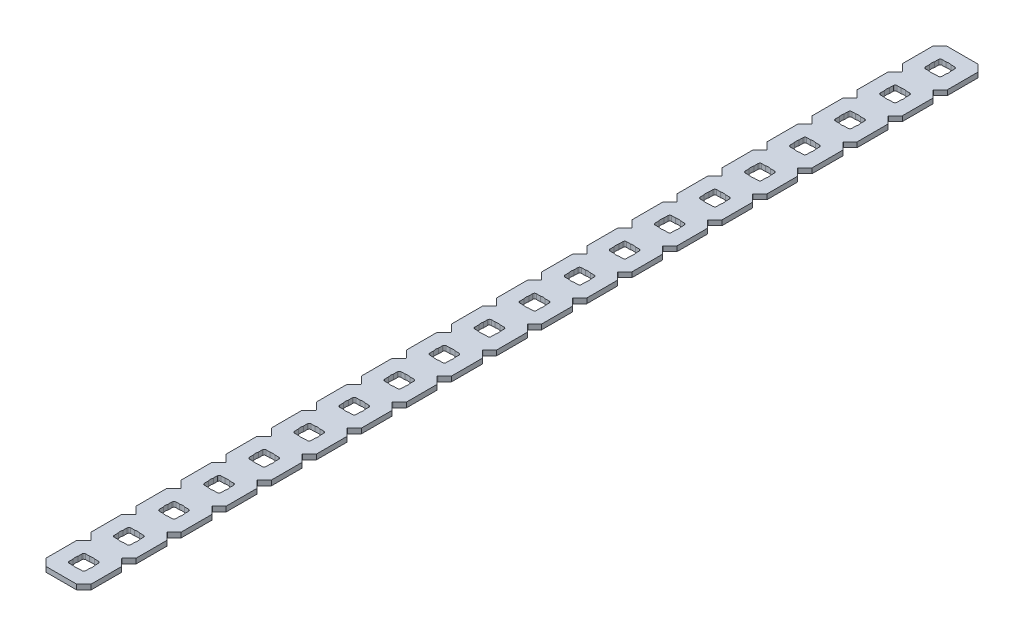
from build123d import *

# Parameters (mm, degrees)
BOSS_EXTRUDE1_DEPTH = 1.4224
SKETCH2_R           = 2.413
CUT_EXTRUDE1_DEPTH  = 2.54
LPATTERN1_COUNT     = 25
LPATTERN1_PITCH     = 12.7
SKETCH3_W           = 12.7
SKETCH3_H           = 63.589802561
CUT_EXTRUDE2_DEPTH  = 318.757082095


with BuildPart() as part:
    # Sketch1 → Boss-Extrude1 (new body)
    with BuildSketch(Plane.XZ):
        with BuildLine():
            Line((12.7, -302.773014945), (12.7, -294.126985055))
            Line((12.7, -294.126985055), (10.762817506, -292.189802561))
            ThreePointArc((10.762817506, -292.189802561), (10.725620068, -292.1), (10.762817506, -292.010197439))
            Line((10.762817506, -292.010197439), (12.7, -290.073014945))
            Line((12.7, -290.073014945), (12.7, -281.426985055))
            Line((12.7, -281.426985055), (10.762817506, -279.489802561))
            ThreePointArc((10.762817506, -279.489802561), (10.725620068, -279.4), (10.762817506, -279.310197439))
            Line((10.762817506, -279.310197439), (12.7, -277.373014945))
            Line((12.7, -277.373014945), (12.7, -268.726985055))
            Line((12.7, -268.726985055), (10.762817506, -266.789802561))
            ThreePointArc((10.762817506, -266.789802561), (10.725620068, -266.7), (10.762817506, -266.610197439))
            Line((10.762817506, -266.610197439), (12.7, -264.673014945))
            Line((12.7, -264.673014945), (12.7, -256.026985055))
            Line((12.7, -256.026985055), (10.762817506, -254.089802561))
            ThreePointArc((10.762817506, -254.089802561), (10.725620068, -254), (10.762817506, -253.910197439))
            Line((10.762817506, -253.910197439), (12.7, -251.973014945))
            Line((12.7, -251.973014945), (12.7, -243.326985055))
            Line((12.7, -243.326985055), (10.762817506, -241.389802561))
            ThreePointArc((10.762817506, -241.389802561), (10.725620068, -241.3), (10.762817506, -241.210197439))
            Line((10.762817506, -241.210197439), (12.7, -239.273014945))
            Line((12.7, -239.273014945), (12.7, -230.626985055))
            Line((12.7, -230.626985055), (10.762817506, -228.689802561))
            ThreePointArc((10.762817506, -228.689802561), (10.725620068, -228.6), (10.762817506, -228.510197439))
            Line((10.762817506, -228.510197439), (12.7, -226.573014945))
            Line((12.7, -226.573014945), (12.7, -217.926985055))
            Line((12.7, -217.926985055), (10.762817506, -215.989802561))
            ThreePointArc((10.762817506, -215.989802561), (10.725620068, -215.9), (10.762817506, -215.810197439))
            Line((10.762817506, -215.810197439), (12.7, -213.873014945))
            Line((12.7, -213.873014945), (12.7, -205.226985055))
            Line((12.7, -205.226985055), (10.762817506, -203.289802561))
            ThreePointArc((10.762817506, -203.289802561), (10.725620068, -203.2), (10.762817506, -203.110197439))
            Line((10.762817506, -203.110197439), (12.7, -201.173014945))
            Line((12.7, -201.173014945), (12.7, -192.526985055))
            Line((12.7, -192.526985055), (10.762817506, -190.589802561))
            ThreePointArc((10.762817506, -190.589802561), (10.725620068, -190.5), (10.762817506, -190.410197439))
            Line((10.762817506, -190.410197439), (12.7, -188.473014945))
            Line((12.7, -188.473014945), (12.7, -179.826985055))
            Line((12.7, -179.826985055), (10.762817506, -177.889802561))
            ThreePointArc((10.762817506, -177.889802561), (10.725620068, -177.8), (10.762817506, -177.710197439))
            Line((10.762817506, -177.710197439), (12.7, -175.773014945))
            Line((12.7, -175.773014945), (12.7, -167.126985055))
            Line((12.7, -167.126985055), (10.762817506, -165.189802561))
            ThreePointArc((10.762817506, -165.189802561), (10.725620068, -165.1), (10.762817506, -165.010197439))
            Line((10.762817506, -165.010197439), (12.7, -163.073014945))
            Line((12.7, -163.073014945), (12.7, -154.426985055))
            Line((12.7, -154.426985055), (10.762817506, -152.489802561))
            ThreePointArc((10.762817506, -152.489802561), (10.725620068, -152.4), (10.762817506, -152.310197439))
            Line((10.762817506, -152.310197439), (12.7, -150.373014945))
            Line((12.7, -150.373014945), (12.7, -141.726985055))
            Line((12.7, -141.726985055), (10.762817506, -139.789802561))
            ThreePointArc((10.762817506, -139.789802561), (10.725620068, -139.7), (10.762817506, -139.610197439))
            Line((10.762817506, -139.610197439), (12.7, -137.673014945))
            Line((12.7, -137.673014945), (12.7, -129.026985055))
            Line((12.7, -129.026985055), (10.762817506, -127.089802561))
            ThreePointArc((10.762817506, -127.089802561), (10.725620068, -127), (10.762817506, -126.910197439))
            Line((10.762817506, -126.910197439), (12.7, -124.973014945))
            Line((12.7, -124.973014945), (12.7, -116.326985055))
            Line((12.7, -116.326985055), (10.762817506, -114.389802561))
            ThreePointArc((10.762817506, -114.389802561), (10.725620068, -114.3), (10.762817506, -114.210197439))
            Line((10.762817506, -114.210197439), (12.7, -112.273014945))
            Line((12.7, -112.273014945), (12.7, -103.626985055))
            Line((12.7, -103.626985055), (10.762817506, -101.689802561))
            ThreePointArc((10.762817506, -101.689802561), (10.725620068, -101.6), (10.762817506, -101.510197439))
            Line((10.762817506, -101.510197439), (12.7, -99.573014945))
            Line((12.7, -99.573014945), (12.7, -90.926985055))
            Line((12.7, -90.926985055), (10.762817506, -88.989802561))
            ThreePointArc((10.762817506, -88.989802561), (10.725620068, -88.9), (10.762817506, -88.810197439))
            Line((10.762817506, -88.810197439), (12.7, -86.873014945))
            Line((12.7, -86.873014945), (12.7, -78.226985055))
            Line((12.7, -78.226985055), (10.762817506, -76.289802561))
            ThreePointArc((10.762817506, -76.289802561), (10.725620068, -76.2), (10.762817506, -76.110197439))
            Line((10.762817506, -76.110197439), (12.7, -74.173014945))
            Line((12.7, -74.173014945), (12.7, -65.526985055))
            Line((12.7, -65.526985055), (10.762817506, -63.589802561))
            ThreePointArc((10.762817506, -63.589802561), (10.725620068, -63.5), (10.762817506, -63.410197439))
            Line((10.762817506, -63.410197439), (12.7, -61.473014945))
            Line((12.7, -61.473014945), (12.7, -52.826985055))
            Line((12.7, -52.826985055), (10.762817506, -50.889802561))
            ThreePointArc((10.762817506, -50.889802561), (10.725620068, -50.8), (10.762817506, -50.710197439))
            Line((10.762817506, -50.710197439), (12.7, -48.773014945))
            Line((12.7, -48.773014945), (12.7, -40.126985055))
            Line((12.7, -40.126985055), (10.762817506, -38.189802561))
            ThreePointArc((10.762817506, -38.189802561), (10.725620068, -38.1), (10.762817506, -38.010197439))
            Line((10.762817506, -38.010197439), (12.7, -36.073014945))
            Line((12.7, -36.073014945), (12.7, -27.426985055))
            Line((12.7, -27.426985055), (10.762817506, -25.489802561))
            ThreePointArc((10.762817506, -25.489802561), (10.725620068, -25.4), (10.762817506, -25.310197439))
            Line((10.762817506, -25.310197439), (12.7, -23.373014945))
            Line((12.7, -23.373014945), (12.7, -14.726985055))
            Line((12.7, -14.726985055), (10.762817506, -12.789802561))
            ThreePointArc((10.762817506, -12.789802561), (10.725620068, -12.7), (10.762817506, -12.610197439))
            Line((10.762817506, -12.610197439), (12.7, -10.673014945))
            Line((12.7, -10.673014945), (12.7, -2.032))
            Line((12.7, -2.032), (10.668, 0))
            Line((10.668, 0), (2.032, 0))
            Line((2.032, 0), (0, -2.032))
            Line((0, -2.032), (0, -10.673014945))
            Line((0, -10.673014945), (1.937182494, -12.610197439))
            ThreePointArc((1.937182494, -12.610197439), (1.974379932, -12.7), (1.937182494, -12.789802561))
            Line((1.937182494, -12.789802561), (0, -14.726985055))
            Line((0, -14.726985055), (0, -23.373014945))
            Line((0, -23.373014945), (1.937182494, -25.310197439))
            ThreePointArc((1.937182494, -25.310197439), (1.974379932, -25.4), (1.937182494, -25.489802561))
            Line((1.937182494, -25.489802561), (0, -27.426985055))
            Line((0, -27.426985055), (0, -36.073014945))
            Line((0, -36.073014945), (1.937182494, -38.010197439))
            ThreePointArc((1.937182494, -38.010197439), (1.974379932, -38.1), (1.937182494, -38.189802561))
            Line((1.937182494, -38.189802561), (0, -40.126985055))
            Line((0, -40.126985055), (0, -48.773014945))
            Line((0, -48.773014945), (1.937182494, -50.710197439))
            ThreePointArc((1.937182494, -50.710197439), (1.974379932, -50.8), (1.937182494, -50.889802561))
            Line((1.937182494, -50.889802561), (0, -52.826985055))
            Line((0, -52.826985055), (0, -61.473014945))
            Line((0, -61.473014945), (1.937182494, -63.410197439))
            ThreePointArc((1.937182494, -63.410197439), (1.974379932, -63.5), (1.937182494, -63.589802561))
            Line((1.937182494, -63.589802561), (0, -65.526985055))
            Line((0, -65.526985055), (0, -74.173014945))
            Line((0, -74.173014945), (1.937182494, -76.110197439))
            ThreePointArc((1.937182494, -76.110197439), (1.974379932, -76.2), (1.937182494, -76.289802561))
            Line((1.937182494, -76.289802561), (0, -78.226985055))
            Line((0, -78.226985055), (0, -86.873014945))
            Line((0, -86.873014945), (1.937182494, -88.810197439))
            ThreePointArc((1.937182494, -88.810197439), (1.974379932, -88.9), (1.937182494, -88.989802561))
            Line((1.937182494, -88.989802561), (0, -90.926985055))
            Line((0, -90.926985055), (0, -99.573014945))
            Line((0, -99.573014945), (1.937182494, -101.510197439))
            ThreePointArc((1.937182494, -101.510197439), (1.974379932, -101.6), (1.937182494, -101.689802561))
            Line((1.937182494, -101.689802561), (0, -103.626985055))
            Line((0, -103.626985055), (0, -112.273014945))
            Line((0, -112.273014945), (1.937182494, -114.210197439))
            ThreePointArc((1.937182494, -114.210197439), (1.974379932, -114.3), (1.937182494, -114.389802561))
            Line((1.937182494, -114.389802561), (0, -116.326985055))
            Line((0, -116.326985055), (0, -124.973014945))
            Line((0, -124.973014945), (1.937182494, -126.910197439))
            ThreePointArc((1.937182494, -126.910197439), (1.974379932, -127), (1.937182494, -127.089802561))
            Line((1.937182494, -127.089802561), (0, -129.026985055))
            Line((0, -129.026985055), (0, -137.673014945))
            Line((0, -137.673014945), (1.937182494, -139.610197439))
            ThreePointArc((1.937182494, -139.610197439), (1.974379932, -139.7), (1.937182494, -139.789802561))
            Line((1.937182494, -139.789802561), (0, -141.726985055))
            Line((0, -141.726985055), (0, -150.373014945))
            Line((0, -150.373014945), (1.937182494, -152.310197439))
            ThreePointArc((1.937182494, -152.310197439), (1.974379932, -152.4), (1.937182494, -152.489802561))
            Line((1.937182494, -152.489802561), (0, -154.426985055))
            Line((0, -154.426985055), (0, -163.073014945))
            Line((0, -163.073014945), (1.937182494, -165.010197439))
            ThreePointArc((1.937182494, -165.010197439), (1.974379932, -165.1), (1.937182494, -165.189802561))
            Line((1.937182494, -165.189802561), (0, -167.126985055))
            Line((0, -167.126985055), (0, -175.773014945))
            Line((0, -175.773014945), (1.937182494, -177.710197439))
            ThreePointArc((1.937182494, -177.710197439), (1.974379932, -177.8), (1.937182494, -177.889802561))
            Line((1.937182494, -177.889802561), (0, -179.826985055))
            Line((0, -179.826985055), (0, -188.473014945))
            Line((0, -188.473014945), (1.937182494, -190.410197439))
            ThreePointArc((1.937182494, -190.410197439), (1.974379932, -190.5), (1.937182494, -190.589802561))
            Line((1.937182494, -190.589802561), (0, -192.526985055))
            Line((0, -192.526985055), (0, -201.173014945))
            Line((0, -201.173014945), (1.937182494, -203.110197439))
            ThreePointArc((1.937182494, -203.110197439), (1.974379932, -203.2), (1.937182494, -203.289802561))
            Line((1.937182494, -203.289802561), (0, -205.226985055))
            Line((0, -205.226985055), (0, -213.873014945))
            Line((0, -213.873014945), (1.937182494, -215.810197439))
            ThreePointArc((1.937182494, -215.810197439), (1.974379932, -215.9), (1.937182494, -215.989802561))
            Line((1.937182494, -215.989802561), (0, -217.926985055))
            Line((0, -217.926985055), (0, -226.573014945))
            Line((0, -226.573014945), (1.937182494, -228.510197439))
            ThreePointArc((1.937182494, -228.510197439), (1.974379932, -228.6), (1.937182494, -228.689802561))
            Line((1.937182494, -228.689802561), (0, -230.626985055))
            Line((0, -230.626985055), (0, -239.273014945))
            Line((0, -239.273014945), (1.937182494, -241.210197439))
            ThreePointArc((1.937182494, -241.210197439), (1.974379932, -241.3), (1.937182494, -241.389802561))
            Line((1.937182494, -241.389802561), (0, -243.326985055))
            Line((0, -243.326985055), (0, -251.973014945))
            Line((0, -251.973014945), (1.937182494, -253.910197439))
            ThreePointArc((1.937182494, -253.910197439), (1.974379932, -254), (1.937182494, -254.089802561))
            Line((1.937182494, -254.089802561), (0, -256.026985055))
            Line((0, -256.026985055), (0, -264.673014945))
            Line((0, -264.673014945), (1.937182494, -266.610197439))
            ThreePointArc((1.937182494, -266.610197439), (1.974379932, -266.7), (1.937182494, -266.789802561))
            Line((1.937182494, -266.789802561), (0, -268.726985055))
            Line((0, -268.726985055), (0, -277.373014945))
            Line((0, -277.373014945), (1.937182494, -279.310197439))
            ThreePointArc((1.937182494, -279.310197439), (1.974379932, -279.4), (1.937182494, -279.489802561))
            Line((1.937182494, -279.489802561), (0, -281.426985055))
            Line((0, -281.426985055), (0, -290.073014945))
            Line((0, -290.073014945), (1.937182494, -292.010197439))
            ThreePointArc((1.937182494, -292.010197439), (1.974379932, -292.1), (1.937182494, -292.189802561))
            Line((1.937182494, -292.189802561), (0, -294.126985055))
            Line((0, -294.126985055), (0, -302.773014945))
            Line((0, -302.773014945), (1.937182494, -304.710197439))
            ThreePointArc((1.937182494, -304.710197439), (1.974379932, -304.8), (1.937182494, -304.889802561))
            Line((1.937182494, -304.889802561), (0, -306.826985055))
            Line((0, -306.826985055), (0, -315.468))
            Line((0, -315.468), (2.032, -317.5))
            Line((2.032, -317.5), (10.668, -317.5))
            Line((10.668, -317.5), (12.7, -315.468))
            Line((12.7, -315.468), (12.7, -306.826985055))
            Line((12.7, -306.826985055), (10.762817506, -304.889802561))
            ThreePointArc((10.762817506, -304.889802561), (10.725620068, -304.8), (10.762817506, -304.710197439))
            Line((10.762817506, -304.710197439), (12.7, -302.773014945))
        make_face()
        with BuildLine():
            Line((4.5466, -308.8386), (8.1534, -308.8386))
            ThreePointArc((8.1534, -308.8386), (8.512610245, -308.987389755), (8.6614, -309.3466))
            Line((8.6614, -309.3466), (8.6614, -312.9534))
            ThreePointArc((8.6614, -312.9534), (8.512610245, -313.312610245), (8.1534, -313.4614))
            Line((8.1534, -313.4614), (4.5466, -313.4614))
            ThreePointArc((4.5466, -313.4614), (4.187389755, -313.312610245), (4.0386, -312.9534))
            Line((4.0386, -312.9534), (4.0386, -309.3466))
            ThreePointArc((4.0386, -309.3466), (4.187389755, -308.987389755), (4.5466, -308.8386))
        make_face(mode=Mode.SUBTRACT)
        with BuildLine():
            Line((4.5466, -296.1386), (8.1534, -296.1386))
            ThreePointArc((8.1534, -296.1386), (8.512610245, -296.287389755), (8.6614, -296.6466))
            Line((8.6614, -296.6466), (8.6614, -300.2534))
            ThreePointArc((8.6614, -300.2534), (8.512610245, -300.612610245), (8.1534, -300.7614))
            Line((8.1534, -300.7614), (4.5466, -300.7614))
            ThreePointArc((4.5466, -300.7614), (4.187389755, -300.612610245), (4.0386, -300.2534))
            Line((4.0386, -300.2534), (4.0386, -296.6466))
            ThreePointArc((4.0386, -296.6466), (4.187389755, -296.287389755), (4.5466, -296.1386))
        make_face(mode=Mode.SUBTRACT)
        with BuildLine():
            Line((4.5466, -283.4386), (8.1534, -283.4386))
            ThreePointArc((8.1534, -283.4386), (8.512610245, -283.587389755), (8.6614, -283.9466))
            Line((8.6614, -283.9466), (8.6614, -287.5534))
            ThreePointArc((8.6614, -287.5534), (8.512610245, -287.912610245), (8.1534, -288.0614))
            Line((8.1534, -288.0614), (4.5466, -288.0614))
            ThreePointArc((4.5466, -288.0614), (4.187389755, -287.912610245), (4.0386, -287.5534))
            Line((4.0386, -287.5534), (4.0386, -283.9466))
            ThreePointArc((4.0386, -283.9466), (4.187389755, -283.587389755), (4.5466, -283.4386))
        make_face(mode=Mode.SUBTRACT)
        with BuildLine():
            Line((4.5466, -270.7386), (8.1534, -270.7386))
            ThreePointArc((8.1534, -270.7386), (8.512610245, -270.887389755), (8.6614, -271.2466))
            Line((8.6614, -271.2466), (8.6614, -274.8534))
            ThreePointArc((8.6614, -274.8534), (8.512610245, -275.212610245), (8.1534, -275.3614))
            Line((8.1534, -275.3614), (4.5466, -275.3614))
            ThreePointArc((4.5466, -275.3614), (4.187389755, -275.212610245), (4.0386, -274.8534))
            Line((4.0386, -274.8534), (4.0386, -271.2466))
            ThreePointArc((4.0386, -271.2466), (4.187389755, -270.887389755), (4.5466, -270.7386))
        make_face(mode=Mode.SUBTRACT)
        with BuildLine():
            Line((4.5466, -258.0386), (8.1534, -258.0386))
            ThreePointArc((8.1534, -258.0386), (8.512610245, -258.187389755), (8.6614, -258.5466))
            Line((8.6614, -258.5466), (8.6614, -262.1534))
            ThreePointArc((8.6614, -262.1534), (8.512610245, -262.512610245), (8.1534, -262.6614))
            Line((8.1534, -262.6614), (4.5466, -262.6614))
            ThreePointArc((4.5466, -262.6614), (4.187389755, -262.512610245), (4.0386, -262.1534))
            Line((4.0386, -262.1534), (4.0386, -258.5466))
            ThreePointArc((4.0386, -258.5466), (4.187389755, -258.187389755), (4.5466, -258.0386))
        make_face(mode=Mode.SUBTRACT)
        with BuildLine():
            Line((4.5466, -245.3386), (8.1534, -245.3386))
            ThreePointArc((8.1534, -245.3386), (8.512610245, -245.487389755), (8.6614, -245.8466))
            Line((8.6614, -245.8466), (8.6614, -249.4534))
            ThreePointArc((8.6614, -249.4534), (8.512610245, -249.812610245), (8.1534, -249.9614))
            Line((8.1534, -249.9614), (4.5466, -249.9614))
            ThreePointArc((4.5466, -249.9614), (4.187389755, -249.812610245), (4.0386, -249.4534))
            Line((4.0386, -249.4534), (4.0386, -245.8466))
            ThreePointArc((4.0386, -245.8466), (4.187389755, -245.487389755), (4.5466, -245.3386))
        make_face(mode=Mode.SUBTRACT)
        with BuildLine():
            Line((4.5466, -232.6386), (8.1534, -232.6386))
            ThreePointArc((8.1534, -232.6386), (8.512610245, -232.787389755), (8.6614, -233.1466))
            Line((8.6614, -233.1466), (8.6614, -236.7534))
            ThreePointArc((8.6614, -236.7534), (8.512610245, -237.112610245), (8.1534, -237.2614))
            Line((8.1534, -237.2614), (4.5466, -237.2614))
            ThreePointArc((4.5466, -237.2614), (4.187389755, -237.112610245), (4.0386, -236.7534))
            Line((4.0386, -236.7534), (4.0386, -233.1466))
            ThreePointArc((4.0386, -233.1466), (4.187389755, -232.787389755), (4.5466, -232.6386))
        make_face(mode=Mode.SUBTRACT)
        with BuildLine():
            Line((4.5466, -219.9386), (8.1534, -219.9386))
            ThreePointArc((8.1534, -219.9386), (8.512610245, -220.087389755), (8.6614, -220.4466))
            Line((8.6614, -220.4466), (8.6614, -224.0534))
            ThreePointArc((8.6614, -224.0534), (8.512610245, -224.412610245), (8.1534, -224.5614))
            Line((8.1534, -224.5614), (4.5466, -224.5614))
            ThreePointArc((4.5466, -224.5614), (4.187389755, -224.412610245), (4.0386, -224.0534))
            Line((4.0386, -224.0534), (4.0386, -220.4466))
            ThreePointArc((4.0386, -220.4466), (4.187389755, -220.087389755), (4.5466, -219.9386))
        make_face(mode=Mode.SUBTRACT)
        with BuildLine():
            Line((4.5466, -207.2386), (8.1534, -207.2386))
            ThreePointArc((8.1534, -207.2386), (8.512610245, -207.387389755), (8.6614, -207.7466))
            Line((8.6614, -207.7466), (8.6614, -211.3534))
            ThreePointArc((8.6614, -211.3534), (8.512610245, -211.712610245), (8.1534, -211.8614))
            Line((8.1534, -211.8614), (4.5466, -211.8614))
            ThreePointArc((4.5466, -211.8614), (4.187389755, -211.712610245), (4.0386, -211.3534))
            Line((4.0386, -211.3534), (4.0386, -207.7466))
            ThreePointArc((4.0386, -207.7466), (4.187389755, -207.387389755), (4.5466, -207.2386))
        make_face(mode=Mode.SUBTRACT)
        with BuildLine():
            Line((4.5466, -194.5386), (8.1534, -194.5386))
            ThreePointArc((8.1534, -194.5386), (8.512610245, -194.687389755), (8.6614, -195.0466))
            Line((8.6614, -195.0466), (8.6614, -198.6534))
            ThreePointArc((8.6614, -198.6534), (8.512610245, -199.012610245), (8.1534, -199.1614))
            Line((8.1534, -199.1614), (4.5466, -199.1614))
            ThreePointArc((4.5466, -199.1614), (4.187389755, -199.012610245), (4.0386, -198.6534))
            Line((4.0386, -198.6534), (4.0386, -195.0466))
            ThreePointArc((4.0386, -195.0466), (4.187389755, -194.687389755), (4.5466, -194.5386))
        make_face(mode=Mode.SUBTRACT)
        with BuildLine():
            Line((4.5466, -181.8386), (8.1534, -181.8386))
            ThreePointArc((8.1534, -181.8386), (8.512610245, -181.987389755), (8.6614, -182.3466))
            Line((8.6614, -182.3466), (8.6614, -185.9534))
            ThreePointArc((8.6614, -185.9534), (8.512610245, -186.312610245), (8.1534, -186.4614))
            Line((8.1534, -186.4614), (4.5466, -186.4614))
            ThreePointArc((4.5466, -186.4614), (4.187389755, -186.312610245), (4.0386, -185.9534))
            Line((4.0386, -185.9534), (4.0386, -182.3466))
            ThreePointArc((4.0386, -182.3466), (4.187389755, -181.987389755), (4.5466, -181.8386))
        make_face(mode=Mode.SUBTRACT)
        with BuildLine():
            Line((4.5466, -169.1386), (8.1534, -169.1386))
            ThreePointArc((8.1534, -169.1386), (8.512610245, -169.287389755), (8.6614, -169.6466))
            Line((8.6614, -169.6466), (8.6614, -173.2534))
            ThreePointArc((8.6614, -173.2534), (8.512610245, -173.612610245), (8.1534, -173.7614))
            Line((8.1534, -173.7614), (4.5466, -173.7614))
            ThreePointArc((4.5466, -173.7614), (4.187389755, -173.612610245), (4.0386, -173.2534))
            Line((4.0386, -173.2534), (4.0386, -169.6466))
            ThreePointArc((4.0386, -169.6466), (4.187389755, -169.287389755), (4.5466, -169.1386))
        make_face(mode=Mode.SUBTRACT)
        with BuildLine():
            Line((4.5466, -156.4386), (8.1534, -156.4386))
            ThreePointArc((8.1534, -156.4386), (8.512610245, -156.587389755), (8.6614, -156.9466))
            Line((8.6614, -156.9466), (8.6614, -160.5534))
            ThreePointArc((8.6614, -160.5534), (8.512610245, -160.912610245), (8.1534, -161.0614))
            Line((8.1534, -161.0614), (4.5466, -161.0614))
            ThreePointArc((4.5466, -161.0614), (4.187389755, -160.912610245), (4.0386, -160.5534))
            Line((4.0386, -160.5534), (4.0386, -156.9466))
            ThreePointArc((4.0386, -156.9466), (4.187389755, -156.587389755), (4.5466, -156.4386))
        make_face(mode=Mode.SUBTRACT)
        with BuildLine():
            Line((4.5466, -143.7386), (8.1534, -143.7386))
            ThreePointArc((8.1534, -143.7386), (8.512610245, -143.887389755), (8.6614, -144.2466))
            Line((8.6614, -144.2466), (8.6614, -147.8534))
            ThreePointArc((8.6614, -147.8534), (8.512610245, -148.212610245), (8.1534, -148.3614))
            Line((8.1534, -148.3614), (4.5466, -148.3614))
            ThreePointArc((4.5466, -148.3614), (4.187389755, -148.212610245), (4.0386, -147.8534))
            Line((4.0386, -147.8534), (4.0386, -144.2466))
            ThreePointArc((4.0386, -144.2466), (4.187389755, -143.887389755), (4.5466, -143.7386))
        make_face(mode=Mode.SUBTRACT)
        with BuildLine():
            Line((4.5466, -131.0386), (8.1534, -131.0386))
            ThreePointArc((8.1534, -131.0386), (8.512610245, -131.187389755), (8.6614, -131.5466))
            Line((8.6614, -131.5466), (8.6614, -135.1534))
            ThreePointArc((8.6614, -135.1534), (8.512610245, -135.512610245), (8.1534, -135.6614))
            Line((8.1534, -135.6614), (4.5466, -135.6614))
            ThreePointArc((4.5466, -135.6614), (4.187389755, -135.512610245), (4.0386, -135.1534))
            Line((4.0386, -135.1534), (4.0386, -131.5466))
            ThreePointArc((4.0386, -131.5466), (4.187389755, -131.187389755), (4.5466, -131.0386))
        make_face(mode=Mode.SUBTRACT)
        with BuildLine():
            Line((4.5466, -118.3386), (8.1534, -118.3386))
            ThreePointArc((8.1534, -118.3386), (8.512610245, -118.487389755), (8.6614, -118.8466))
            Line((8.6614, -118.8466), (8.6614, -122.4534))
            ThreePointArc((8.6614, -122.4534), (8.512610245, -122.812610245), (8.1534, -122.9614))
            Line((8.1534, -122.9614), (4.5466, -122.9614))
            ThreePointArc((4.5466, -122.9614), (4.187389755, -122.812610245), (4.0386, -122.4534))
            Line((4.0386, -122.4534), (4.0386, -118.8466))
            ThreePointArc((4.0386, -118.8466), (4.187389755, -118.487389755), (4.5466, -118.3386))
        make_face(mode=Mode.SUBTRACT)
        with BuildLine():
            Line((4.5466, -105.6386), (8.1534, -105.6386))
            ThreePointArc((8.1534, -105.6386), (8.512610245, -105.787389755), (8.6614, -106.1466))
            Line((8.6614, -106.1466), (8.6614, -109.7534))
            ThreePointArc((8.6614, -109.7534), (8.512610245, -110.112610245), (8.1534, -110.2614))
            Line((8.1534, -110.2614), (4.5466, -110.2614))
            ThreePointArc((4.5466, -110.2614), (4.187389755, -110.112610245), (4.0386, -109.7534))
            Line((4.0386, -109.7534), (4.0386, -106.1466))
            ThreePointArc((4.0386, -106.1466), (4.187389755, -105.787389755), (4.5466, -105.6386))
        make_face(mode=Mode.SUBTRACT)
        with BuildLine():
            Line((4.5466, -92.9386), (8.1534, -92.9386))
            ThreePointArc((8.1534, -92.9386), (8.512610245, -93.087389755), (8.6614, -93.4466))
            Line((8.6614, -93.4466), (8.6614, -97.0534))
            ThreePointArc((8.6614, -97.0534), (8.512610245, -97.412610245), (8.1534, -97.5614))
            Line((8.1534, -97.5614), (4.5466, -97.5614))
            ThreePointArc((4.5466, -97.5614), (4.187389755, -97.412610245), (4.0386, -97.0534))
            Line((4.0386, -97.0534), (4.0386, -93.4466))
            ThreePointArc((4.0386, -93.4466), (4.187389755, -93.087389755), (4.5466, -92.9386))
        make_face(mode=Mode.SUBTRACT)
        with BuildLine():
            Line((4.5466, -80.2386), (8.1534, -80.2386))
            ThreePointArc((8.1534, -80.2386), (8.512610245, -80.387389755), (8.6614, -80.7466))
            Line((8.6614, -80.7466), (8.6614, -84.3534))
            ThreePointArc((8.6614, -84.3534), (8.512610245, -84.712610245), (8.1534, -84.8614))
            Line((8.1534, -84.8614), (4.5466, -84.8614))
            ThreePointArc((4.5466, -84.8614), (4.187389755, -84.712610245), (4.0386, -84.3534))
            Line((4.0386, -84.3534), (4.0386, -80.7466))
            ThreePointArc((4.0386, -80.7466), (4.187389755, -80.387389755), (4.5466, -80.2386))
        make_face(mode=Mode.SUBTRACT)
        with BuildLine():
            Line((4.5466, -67.5386), (8.1534, -67.5386))
            ThreePointArc((8.1534, -67.5386), (8.512610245, -67.687389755), (8.6614, -68.0466))
            Line((8.6614, -68.0466), (8.6614, -71.6534))
            ThreePointArc((8.6614, -71.6534), (8.512610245, -72.012610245), (8.1534, -72.1614))
            Line((8.1534, -72.1614), (4.5466, -72.1614))
            ThreePointArc((4.5466, -72.1614), (4.187389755, -72.012610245), (4.0386, -71.6534))
            Line((4.0386, -71.6534), (4.0386, -68.0466))
            ThreePointArc((4.0386, -68.0466), (4.187389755, -67.687389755), (4.5466, -67.5386))
        make_face(mode=Mode.SUBTRACT)
        with BuildLine():
            Line((4.5466, -54.8386), (8.1534, -54.8386))
            ThreePointArc((8.1534, -54.8386), (8.512610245, -54.987389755), (8.6614, -55.3466))
            Line((8.6614, -55.3466), (8.6614, -58.9534))
            ThreePointArc((8.6614, -58.9534), (8.512610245, -59.312610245), (8.1534, -59.4614))
            Line((8.1534, -59.4614), (4.5466, -59.4614))
            ThreePointArc((4.5466, -59.4614), (4.187389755, -59.312610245), (4.0386, -58.9534))
            Line((4.0386, -58.9534), (4.0386, -55.3466))
            ThreePointArc((4.0386, -55.3466), (4.187389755, -54.987389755), (4.5466, -54.8386))
        make_face(mode=Mode.SUBTRACT)
        with BuildLine():
            Line((4.5466, -42.1386), (8.1534, -42.1386))
            ThreePointArc((8.1534, -42.1386), (8.512610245, -42.287389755), (8.6614, -42.6466))
            Line((8.6614, -42.6466), (8.6614, -46.2534))
            ThreePointArc((8.6614, -46.2534), (8.512610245, -46.612610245), (8.1534, -46.7614))
            Line((8.1534, -46.7614), (4.5466, -46.7614))
            ThreePointArc((4.5466, -46.7614), (4.187389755, -46.612610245), (4.0386, -46.2534))
            Line((4.0386, -46.2534), (4.0386, -42.6466))
            ThreePointArc((4.0386, -42.6466), (4.187389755, -42.287389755), (4.5466, -42.1386))
        make_face(mode=Mode.SUBTRACT)
        with BuildLine():
            Line((4.5466, -29.4386), (8.1534, -29.4386))
            ThreePointArc((8.1534, -29.4386), (8.512610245, -29.587389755), (8.6614, -29.9466))
            Line((8.6614, -29.9466), (8.6614, -33.5534))
            ThreePointArc((8.6614, -33.5534), (8.512610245, -33.912610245), (8.1534, -34.0614))
            Line((8.1534, -34.0614), (4.5466, -34.0614))
            ThreePointArc((4.5466, -34.0614), (4.187389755, -33.912610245), (4.0386, -33.5534))
            Line((4.0386, -33.5534), (4.0386, -29.9466))
            ThreePointArc((4.0386, -29.9466), (4.187389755, -29.587389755), (4.5466, -29.4386))
        make_face(mode=Mode.SUBTRACT)
        with BuildLine():
            Line((8.1534, -8.6614), (4.5466, -8.6614))
            ThreePointArc((4.5466, -8.6614), (4.187389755, -8.512610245), (4.0386, -8.1534))
            Line((4.0386, -8.1534), (4.0386, -4.5466))
            ThreePointArc((4.0386, -4.5466), (4.187389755, -4.187389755), (4.5466, -4.0386))
            Line((4.5466, -4.0386), (8.1534, -4.0386))
            ThreePointArc((8.1534, -4.0386), (8.512610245, -4.187389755), (8.6614, -4.5466))
            Line((8.6614, -4.5466), (8.6614, -8.1534))
            ThreePointArc((8.6614, -8.1534), (8.512610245, -8.512610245), (8.1534, -8.6614))
        make_face(mode=Mode.SUBTRACT)
        with BuildLine():
            Line((4.0386, -20.8534), (4.0386, -17.2466))
            ThreePointArc((4.0386, -17.2466), (4.187389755, -16.887389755), (4.5466, -16.7386))
            Line((4.5466, -16.7386), (8.1534, -16.7386))
            ThreePointArc((8.1534, -16.7386), (8.512610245, -16.887389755), (8.6614, -17.2466))
            Line((8.6614, -17.2466), (8.6614, -20.8534))
            ThreePointArc((8.6614, -20.8534), (8.512610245, -21.212610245), (8.1534, -21.3614))
            Line((8.1534, -21.3614), (4.5466, -21.3614))
            ThreePointArc((4.5466, -21.3614), (4.187389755, -21.212610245), (4.0386, -20.8534))
        make_face(mode=Mode.SUBTRACT)
    extrude(amount=-BOSS_EXTRUDE1_DEPTH)

    # Sketch2 → Cut-Extrude1 (cut)
    with BuildSketch(Plane(origin=(0, 1.4224, 0), x_dir=(1, 0, 0), z_dir=(0, 1, 0))):
        with Locations((6.35, 6.35)):
            Circle(SKETCH2_R)
    cut_extrude1 = extrude(amount=-CUT_EXTRUDE1_DEPTH, mode=Mode.SUBTRACT)

    # LPattern1: Cut-Extrude1 ×25
    with Locations(*[(0, 0, -i * LPATTERN1_PITCH) for i in range(1, LPATTERN1_COUNT)]):
        add(cut_extrude1, mode=Mode.SUBTRACT)

    # Sketch3 → Cut-Extrude2 (cut, through all)
    with BuildSketch(Plane(origin=(0, 1.4224, 0), x_dir=(1, 0, 0), z_dir=(0, 1, 0))):
        with Locations((6.35, 285.70509872)):
            Rectangle(SKETCH3_W, SKETCH3_H)
    extrude(amount=-CUT_EXTRUDE2_DEPTH, mode=Mode.SUBTRACT)


solid = part.part
